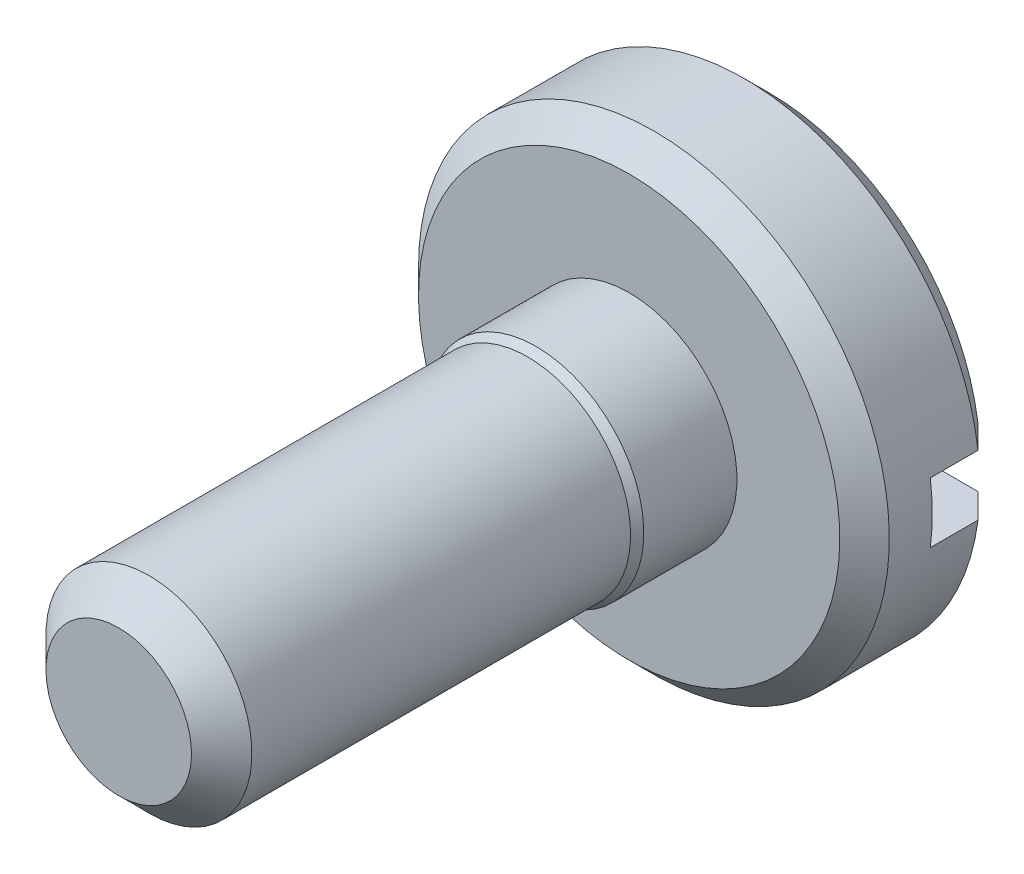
ISO-10303-21;
HEADER;
FILE_DESCRIPTION(('STEP AP214'),'2;1');
FILE_NAME('part.step','',(''),(''),'','','');
FILE_SCHEMA(('AUTOMOTIVE_DESIGN { 1 0 10303 214 1 1 1 1 }'));
ENDSEC;
DATA;
#1=APPLICATION_CONTEXT('core data for automotive mechanical design processes');
#2=APPLICATION_PROTOCOL_DEFINITION('international standard','automotive_design',2000,#1);
#3=PRODUCT_CONTEXT('',#1,'mechanical');
#4=PRODUCT('Part','Part','',(#3));
#5=PRODUCT_RELATED_PRODUCT_CATEGORY('part','',(#4));
#6=PRODUCT_DEFINITION_FORMATION('','',#4);
#7=PRODUCT_DEFINITION_CONTEXT('part definition',#1,'design');
#8=PRODUCT_DEFINITION('design','',#6,#7);
#9=PRODUCT_DEFINITION_SHAPE('','',#8);
#10=(LENGTH_UNIT() NAMED_UNIT(*) SI_UNIT(.MILLI.,.METRE.));
#11=(NAMED_UNIT(*) PLANE_ANGLE_UNIT() SI_UNIT($,.RADIAN.));
#12=(NAMED_UNIT(*) SI_UNIT($,.STERADIAN.) SOLID_ANGLE_UNIT());
#13=UNCERTAINTY_MEASURE_WITH_UNIT(LENGTH_MEASURE(1.E-05),#10,'distance_accuracy_value','');
#14=(GEOMETRIC_REPRESENTATION_CONTEXT(3) GLOBAL_UNCERTAINTY_ASSIGNED_CONTEXT((#13)) GLOBAL_UNIT_ASSIGNED_CONTEXT((#10,
#11,#12)) REPRESENTATION_CONTEXT('',''));
#15=CARTESIAN_POINT('',(0.,0.,0.));
#16=DIRECTION('',(0.,0.,1.));
#17=DIRECTION('',(1.,0.,0.));
#18=AXIS2_PLACEMENT_3D('',#15,#16,#17);
#19=CARTESIAN_POINT('',(-6.1849,0.79375,-15.1892));
#20=DIRECTION('',(0.,0.,1.));
#21=DIRECTION('',(1.,0.,0.));
#22=AXIS2_PLACEMENT_3D('',#19,#20,#21);
#23=PLANE('',#22);
#24=DIRECTION('',(1.,0.,0.));
#25=VECTOR('',#24,1.);
#26=CARTESIAN_POINT('',(-6.1849,-0.79375,-15.1892));
#27=LINE('',#26,#25);
#28=CARTESIAN_POINT('',(6.13375488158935,-0.79375,-15.1892));
#29=VERTEX_POINT('',#28);
#30=CARTESIAN_POINT('',(-6.13375488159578,-0.79375,-15.1892));
#31=VERTEX_POINT('',#30);
#32=EDGE_CURVE('E74',#29,#31,#27,.F.);
#33=ORIENTED_EDGE('',*,*,#32,.T.);
#34=CARTESIAN_POINT('',(0.,0.,-15.1892));
#35=DIRECTION('',(0.,0.,1.));
#36=DIRECTION('',(0.,-1.,0.));
#37=AXIS2_PLACEMENT_3D('',#34,#35,#36);
#38=CIRCLE('',#37,6.1849);
#39=CARTESIAN_POINT('',(-6.13375488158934,0.79375,-15.1892));
#40=VERTEX_POINT('',#39);
#41=EDGE_CURVE('E21',#40,#31,#38,.T.);
#42=ORIENTED_EDGE('',*,*,#41,.F.);
#43=DIRECTION('',(1.,0.,0.));
#44=VECTOR('',#43,1.);
#45=CARTESIAN_POINT('',(-6.1849,0.79375,-15.1892));
#46=LINE('',#45,#44);
#47=CARTESIAN_POINT('',(6.13375488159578,0.79375,-15.1892));
#48=VERTEX_POINT('',#47);
#49=EDGE_CURVE('E71',#40,#48,#46,.T.);
#50=ORIENTED_EDGE('',*,*,#49,.T.);
#51=CARTESIAN_POINT('',(0.,0.,-15.1892));
#52=DIRECTION('',(0.,0.,1.));
#53=DIRECTION('',(0.,-1.,0.));
#54=AXIS2_PLACEMENT_3D('',#51,#52,#53);
#55=CIRCLE('',#54,6.1849);
#56=EDGE_CURVE('E78',#29,#48,#55,.T.);
#57=ORIENTED_EDGE('',*,*,#56,.F.);
#58=EDGE_LOOP('',(#33,#42,#50,#57));
#59=FACE_BOUND('',#58,.T.);
#60=ADVANCED_FACE('F18',(#59),#23,.F.);
#61=CARTESIAN_POINT('',(-6.1849,0.79375,-17.0942));
#62=DIRECTION('',(0.,1.,0.));
#63=DIRECTION('',(0.,0.,1.));
#64=AXIS2_PLACEMENT_3D('',#61,#62,#63);
#65=PLANE('',#64);
#66=CARTESIAN_POINT('',(-5.47680505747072,0.79375,-17.0941999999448));
#67=CARTESIAN_POINT('',(-5.58635318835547,0.79375,-16.9857778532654));
#68=CARTESIAN_POINT('',(-5.69587307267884,0.79375,-16.8773271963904));
#69=CARTESIAN_POINT('',(-5.91485634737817,0.79375,-16.6603688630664));
#70=CARTESIAN_POINT('',(-6.02431973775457,0.79375,-16.5518611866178));
#71=CARTESIAN_POINT('',(-6.13375488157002,0.79375,-16.4433249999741));
#72=B_SPLINE_CURVE_WITH_KNOTS('',3,(#66,#67,#68,#69,#70,#71),.UNSPECIFIED.,.F.,.F.,(4,2,4),(0.,
0.462390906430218,0.924781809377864),.UNSPECIFIED.);
#73=CARTESIAN_POINT('',(-5.47680505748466,0.79375,-17.094199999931));
#74=VERTEX_POINT('',#73);
#75=CARTESIAN_POINT('',(-6.13375488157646,0.79375,-16.443324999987));
#76=VERTEX_POINT('',#75);
#77=EDGE_CURVE('E86',#74,#76,#72,.T.);
#78=ORIENTED_EDGE('',*,*,#77,.F.);
#79=DIRECTION('',(1.,0.,0.));
#80=VECTOR('',#79,1.);
#81=CARTESIAN_POINT('',(0.,0.79375,-17.0942));
#82=LINE('',#81,#80);
#83=CARTESIAN_POINT('',(5.47680505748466,0.79375,-17.094199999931));
#84=VERTEX_POINT('',#83);
#85=EDGE_CURVE('E216',#74,#84,#82,.T.);
#86=ORIENTED_EDGE('',*,*,#85,.T.);
#87=CARTESIAN_POINT('',(6.13375488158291,0.79375,-16.4433249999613));
#88=CARTESIAN_POINT('',(6.02431973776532,0.79375,-16.5518611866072));
#89=CARTESIAN_POINT('',(5.91485634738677,0.79375,-16.6603688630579));
#90=CARTESIAN_POINT('',(5.69587307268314,0.79375,-16.8773271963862));
#91=CARTESIAN_POINT('',(5.58635318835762,0.79375,-16.9857778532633));
#92=CARTESIAN_POINT('',(5.47680505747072,0.79375,-17.0941999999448));
#93=B_SPLINE_CURVE_WITH_KNOTS('',3,(#87,#88,#89,#90,#91,#92),.UNSPECIFIED.,.F.,.F.,(4,2,4),(0.,
0.462390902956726,0.924781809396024),.UNSPECIFIED.);
#94=CARTESIAN_POINT('',(6.13375488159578,0.79375,-16.4433249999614));
#95=VERTEX_POINT('',#94);
#96=EDGE_CURVE('E92',#95,#84,#93,.T.);
#97=ORIENTED_EDGE('',*,*,#96,.F.);
#98=DIRECTION('',(0.,0.,1.));
#99=VECTOR('',#98,1.);
#100=CARTESIAN_POINT('',(6.13375488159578,0.79375,-17.0942));
#101=LINE('',#100,#99);
#102=EDGE_CURVE('E90',#48,#95,#101,.F.);
#103=ORIENTED_EDGE('',*,*,#102,.F.);
#104=ORIENTED_EDGE('',*,*,#49,.F.);
#105=DIRECTION('',(0.,0.,1.));
#106=VECTOR('',#105,1.);
#107=CARTESIAN_POINT('',(-6.13375488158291,0.79375,-17.0942));
#108=LINE('',#107,#106);
#109=EDGE_CURVE('E80',#76,#40,#108,.T.);
#110=ORIENTED_EDGE('',*,*,#109,.F.);
#111=EDGE_LOOP('',(#78,#86,#97,#103,#104,#110));
#112=FACE_BOUND('',#111,.T.);
#113=ADVANCED_FACE('F88',(#112),#65,.F.);
#114=CARTESIAN_POINT('',(-6.1849,-0.79375,-17.0942));
#115=DIRECTION('',(0.,-1.,0.));
#116=DIRECTION('',(0.,0.,-1.));
#117=AXIS2_PLACEMENT_3D('',#114,#115,#116);
#118=PLANE('',#117);
#119=CARTESIAN_POINT('',(5.47680505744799,-0.79375,-17.0941999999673));
#120=CARTESIAN_POINT('',(5.58635318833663,-0.79375,-16.9857778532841));
#121=CARTESIAN_POINT('',(5.69587307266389,-0.79375,-16.8773271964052));
#122=CARTESIAN_POINT('',(5.91485634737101,-0.79375,-16.6603688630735));
#123=CARTESIAN_POINT('',(6.02431973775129,-0.79375,-16.5518611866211));
#124=CARTESIAN_POINT('',(6.13375488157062,-0.79375,-16.4433249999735));
#125=B_SPLINE_CURVE_WITH_KNOTS('',3,(#119,#120,#121,#122,#123,#124),.UNSPECIFIED.,.F.,.F.,(4,2,
4),(0.,0.462390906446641,0.924781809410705),.UNSPECIFIED.);
#126=CARTESIAN_POINT('',(5.47680505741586,-0.79375,-17.0941999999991));
#127=VERTEX_POINT('',#126);
#128=CARTESIAN_POINT('',(6.13375488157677,-0.79375,-16.4433249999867));
#129=VERTEX_POINT('',#128);
#130=EDGE_CURVE('E36',#127,#129,#125,.T.);
#131=ORIENTED_EDGE('',*,*,#130,.F.);
#132=DIRECTION('',(1.,0.,0.));
#133=VECTOR('',#132,1.);
#134=CARTESIAN_POINT('',(0.,-0.79375,-17.0942));
#135=LINE('',#134,#133);
#136=CARTESIAN_POINT('',(-5.47680505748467,-0.79375,-17.094199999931));
#137=VERTEX_POINT('',#136);
#138=EDGE_CURVE('E113',#127,#137,#135,.F.);
#139=ORIENTED_EDGE('',*,*,#138,.T.);
#140=CARTESIAN_POINT('',(-6.13375488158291,-0.79375,-16.4433249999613));
#141=CARTESIAN_POINT('',(-6.02431973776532,-0.79375,-16.5518611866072));
#142=CARTESIAN_POINT('',(-5.91485634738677,-0.79375,-16.6603688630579));
#143=CARTESIAN_POINT('',(-5.69587307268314,-0.79375,-16.8773271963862));
#144=CARTESIAN_POINT('',(-5.58635318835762,-0.79375,-16.9857778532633));
#145=CARTESIAN_POINT('',(-5.47680505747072,-0.79375,-17.0941999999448));
#146=B_SPLINE_CURVE_WITH_KNOTS('',3,(#140,#141,#142,#143,#144,#145),.UNSPECIFIED.,.F.,.F.,(4,2,
4),(0.,0.462390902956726,0.924781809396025),.UNSPECIFIED.);
#147=CARTESIAN_POINT('',(-6.13375488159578,-0.79375,-16.4433249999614));
#148=VERTEX_POINT('',#147);
#149=EDGE_CURVE('E122',#148,#137,#146,.T.);
#150=ORIENTED_EDGE('',*,*,#149,.F.);
#151=DIRECTION('',(0.,0.,-1.));
#152=VECTOR('',#151,1.);
#153=CARTESIAN_POINT('',(-6.13375488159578,-0.79375,-17.0942));
#154=LINE('',#153,#152);
#155=EDGE_CURVE('E221',#31,#148,#154,.T.);
#156=ORIENTED_EDGE('',*,*,#155,.F.);
#157=ORIENTED_EDGE('',*,*,#32,.F.);
#158=DIRECTION('',(0.,0.,-1.));
#159=VECTOR('',#158,1.);
#160=CARTESIAN_POINT('',(6.13375488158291,-0.79375,-17.0942));
#161=LINE('',#160,#159);
#162=EDGE_CURVE('E121',#129,#29,#161,.F.);
#163=ORIENTED_EDGE('',*,*,#162,.F.);
#164=EDGE_LOOP('',(#131,#139,#150,#156,#157,#163));
#165=FACE_BOUND('',#164,.T.);
#166=ADVANCED_FACE('F128',(#165),#118,.F.);
#167=CARTESIAN_POINT('',(0.,0.,-17.0942));
#168=DIRECTION('',(0.,0.,1.));
#169=DIRECTION('',(0.,-1.,0.));
#170=AXIS2_PLACEMENT_3D('',#167,#168,#169);
#171=PLANE('',#170);
#172=CARTESIAN_POINT('',(0.,0.,-17.0941999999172));
#173=DIRECTION('',(0.,0.,1.));
#174=DIRECTION('',(0.,-1.,0.));
#175=AXIS2_PLACEMENT_3D('',#172,#173,#174);
#176=CIRCLE('',#175,5.53402499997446);
#177=EDGE_CURVE('E110',#84,#74,#176,.T.);
#178=ORIENTED_EDGE('',*,*,#177,.F.);
#179=ORIENTED_EDGE('',*,*,#85,.F.);
#180=EDGE_LOOP('',(#178,#179));
#181=FACE_BOUND('',#180,.T.);
#182=ADVANCED_FACE('F163',(#181),#171,.F.);
#183=CARTESIAN_POINT('',(0.,0.,-17.0942));
#184=DIRECTION('',(0.,0.,1.));
#185=DIRECTION('',(0.,-1.,0.));
#186=AXIS2_PLACEMENT_3D('',#183,#184,#185);
#187=PLANE('',#186);
#188=CARTESIAN_POINT('',(0.,0.,-17.0942000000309));
#189=DIRECTION('',(0.,0.,1.));
#190=DIRECTION('',(0.,-1.,0.));
#191=AXIS2_PLACEMENT_3D('',#188,#189,#190);
#192=CIRCLE('',#191,5.53402499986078);
#193=EDGE_CURVE('E107',#137,#127,#192,.T.);
#194=ORIENTED_EDGE('',*,*,#193,.F.);
#195=ORIENTED_EDGE('',*,*,#138,.F.);
#196=EDGE_LOOP('',(#194,#195));
#197=FACE_BOUND('',#196,.T.);
#198=ADVANCED_FACE('F143',(#197),#187,.F.);
#199=CARTESIAN_POINT('',(0.,0.,-16.4433250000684));
#200=DIRECTION('',(0.,0.,1.));
#201=DIRECTION('',(0.,-1.,0.));
#202=AXIS2_PLACEMENT_3D('',#199,#200,#201);
#203=CONICAL_SURFACE('',#202,6.18489999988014,0.785398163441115);
#204=ORIENTED_EDGE('',*,*,#96,.T.);
#205=ORIENTED_EDGE('',*,*,#177,.T.);
#206=ORIENTED_EDGE('',*,*,#77,.T.);
#207=CARTESIAN_POINT('',(0.,0.,-16.4433249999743));
#208=DIRECTION('',(0.,0.,1.));
#209=DIRECTION('',(0.,-1.,0.));
#210=AXIS2_PLACEMENT_3D('',#207,#208,#209);
#211=CIRCLE('',#210,6.1849);
#212=EDGE_CURVE('E83',#95,#76,#211,.T.);
#213=ORIENTED_EDGE('',*,*,#212,.F.);
#214=EDGE_LOOP('',(#204,#205,#206,#213));
#215=FACE_BOUND('',#214,.T.);
#216=ADVANCED_FACE('F136',(#215),#203,.T.);
#217=CARTESIAN_POINT('',(0.,0.,-16.4433250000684));
#218=DIRECTION('',(0.,0.,1.));
#219=DIRECTION('',(0.,-1.,0.));
#220=AXIS2_PLACEMENT_3D('',#217,#218,#219);
#221=CONICAL_SURFACE('',#220,6.18489999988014,0.785398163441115);
#222=ORIENTED_EDGE('',*,*,#130,.T.);
#223=CARTESIAN_POINT('',(0.,0.,-16.443325));
#224=DIRECTION('',(0.,0.,1.));
#225=DIRECTION('',(0.,-1.,0.));
#226=AXIS2_PLACEMENT_3D('',#223,#224,#225);
#227=CIRCLE('',#226,6.1849);
#228=EDGE_CURVE('E203',#148,#129,#227,.T.);
#229=ORIENTED_EDGE('',*,*,#228,.F.);
#230=ORIENTED_EDGE('',*,*,#149,.T.);
#231=ORIENTED_EDGE('',*,*,#193,.T.);
#232=EDGE_LOOP('',(#222,#229,#230,#231));
#233=FACE_BOUND('',#232,.T.);
#234=ADVANCED_FACE('F131',(#233),#221,.T.);
#235=CARTESIAN_POINT('',(0.,0.,0.));
#236=DIRECTION('',(0.,0.,1.));
#237=DIRECTION('',(0.,-1.,0.));
#238=AXIS2_PLACEMENT_3D('',#235,#236,#237);
#239=CYLINDRICAL_SURFACE('',#238,6.1849);
#240=CARTESIAN_POINT('',(0.,0.,-14.0620750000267));
#241=DIRECTION('',(0.,0.,-1.));
#242=DIRECTION('',(0.,1.,0.));
#243=AXIS2_PLACEMENT_3D('',#240,#241,#242);
#244=CIRCLE('',#243,6.18489999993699);
#245=CARTESIAN_POINT('',(0.,6.18489999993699,-14.0620750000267));
#246=VERTEX_POINT('',#245);
#247=EDGE_CURVE('E106',#246,#246,#244,.F.);
#248=ORIENTED_EDGE('',*,*,#247,.F.);
#249=EDGE_LOOP('',(#248));
#250=FACE_BOUND('',#249,.T.);
#251=ORIENTED_EDGE('',*,*,#56,.T.);
#252=ORIENTED_EDGE('',*,*,#102,.T.);
#253=ORIENTED_EDGE('',*,*,#212,.T.);
#254=ORIENTED_EDGE('',*,*,#109,.T.);
#255=ORIENTED_EDGE('',*,*,#41,.T.);
#256=ORIENTED_EDGE('',*,*,#155,.T.);
#257=ORIENTED_EDGE('',*,*,#228,.T.);
#258=ORIENTED_EDGE('',*,*,#162,.T.);
#259=EDGE_LOOP('',(#251,#252,#253,#254,#255,#256,#257,#258));
#260=FACE_BOUND('',#259,.T.);
#261=ADVANCED_FACE('F81',(#250,#260),#239,.T.);
#262=CARTESIAN_POINT('',(0.,0.,-14.0620750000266));
#263=DIRECTION('',(0.,0.,-1.));
#264=DIRECTION('',(0.,1.,0.));
#265=AXIS2_PLACEMENT_3D('',#262,#263,#264);
#266=CONICAL_SURFACE('',#265,6.18489999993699,0.785398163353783);
#267=ORIENTED_EDGE('',*,*,#247,.T.);
#268=EDGE_LOOP('',(#267));
#269=FACE_BOUND('',#268,.T.);
#270=CARTESIAN_POINT('',(0.,0.,-13.4111999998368));
#271=DIRECTION('',(0.,0.,-1.));
#272=DIRECTION('',(0.,1.,0.));
#273=AXIS2_PLACEMENT_3D('',#270,#271,#272);
#274=CIRCLE('',#273,5.53402499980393);
#275=CARTESIAN_POINT('',(0.,5.53402499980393,-13.4111999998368));
#276=VERTEX_POINT('',#275);
#277=EDGE_CURVE('E103',#276,#276,#274,.T.);
#278=ORIENTED_EDGE('',*,*,#277,.T.);
#279=EDGE_LOOP('',(#278));
#280=FACE_BOUND('',#279,.T.);
#281=ADVANCED_FACE('F190',(#269,#280),#266,.T.);
#282=CARTESIAN_POINT('',(0.,2.8321,-13.4112));
#283=DIRECTION('',(0.,0.,-1.));
#284=DIRECTION('',(0.,1.,0.));
#285=AXIS2_PLACEMENT_3D('',#282,#283,#284);
#286=PLANE('',#285);
#287=CARTESIAN_POINT('',(0.,0.,-13.4112));
#288=DIRECTION('',(0.,0.,1.));
#289=DIRECTION('',(0.,-1.,0.));
#290=AXIS2_PLACEMENT_3D('',#287,#288,#289);
#291=CIRCLE('',#290,2.8321);
#292=CARTESIAN_POINT('',(0.,-2.83210000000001,-13.4112));
#293=VERTEX_POINT('',#292);
#294=EDGE_CURVE('E100',#293,#293,#291,.T.);
#295=ORIENTED_EDGE('',*,*,#294,.F.);
#296=EDGE_LOOP('',(#295));
#297=FACE_BOUND('',#296,.T.);
#298=ORIENTED_EDGE('',*,*,#277,.F.);
#299=EDGE_LOOP('',(#298));
#300=FACE_BOUND('',#299,.T.);
#301=ADVANCED_FACE('F187',(#297,#300),#286,.F.);
#302=CARTESIAN_POINT('',(0.,0.,0.));
#303=DIRECTION('',(0.,0.,1.));
#304=DIRECTION('',(0.,-1.,0.));
#305=AXIS2_PLACEMENT_3D('',#302,#303,#304);
#306=CYLINDRICAL_SURFACE('',#305,2.8321);
#307=CARTESIAN_POINT('',(0.,0.,-10.9641704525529));
#308=DIRECTION('',(0.,0.,-1.));
#309=DIRECTION('',(0.,1.,0.));
#310=AXIS2_PLACEMENT_3D('',#307,#308,#309);
#311=CIRCLE('',#310,2.83210000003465);
#312=CARTESIAN_POINT('',(0.,2.83210000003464,-10.9641704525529));
#313=VERTEX_POINT('',#312);
#314=EDGE_CURVE('E99',#313,#313,#311,.F.);
#315=ORIENTED_EDGE('',*,*,#314,.F.);
#316=EDGE_LOOP('',(#315));
#317=FACE_BOUND('',#316,.T.);
#318=ORIENTED_EDGE('',*,*,#294,.T.);
#319=EDGE_LOOP('',(#318));
#320=FACE_BOUND('',#319,.T.);
#321=ADVANCED_FACE('F183',(#317,#320),#306,.T.);
#322=CARTESIAN_POINT('',(0.,0.,0.));
#323=DIRECTION('',(0.,0.,-1.));
#324=DIRECTION('',(0.,1.,0.));
#325=AXIS2_PLACEMENT_3D('',#322,#323,#324);
#326=PLANE('',#325);
#327=CARTESIAN_POINT('',(0.,0.,-2.27373458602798E-10));
#328=DIRECTION('',(0.,0.,-1.));
#329=DIRECTION('',(0.,1.,0.));
#330=AXIS2_PLACEMENT_3D('',#327,#328,#329);
#331=CIRCLE('',#330,1.91135000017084);
#332=CARTESIAN_POINT('',(0.,1.91135000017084,-2.27373803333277E-10));
#333=VERTEX_POINT('',#332);
#334=EDGE_CURVE('E96',#333,#333,#331,.T.);
#335=ORIENTED_EDGE('',*,*,#334,.F.);
#336=EDGE_LOOP('',(#335));
#337=FACE_BOUND('',#336,.T.);
#338=ADVANCED_FACE('F179',(#337),#326,.F.);
#339=CARTESIAN_POINT('',(0.,0.,-10.9641704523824));
#340=DIRECTION('',(0.,0.,-1.));
#341=DIRECTION('',(0.,1.,0.));
#342=AXIS2_PLACEMENT_3D('',#339,#340,#341);
#343=CONICAL_SURFACE('',#342,2.83209999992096,0.523598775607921);
#344=ORIENTED_EDGE('',*,*,#314,.T.);
#345=EDGE_LOOP('',(#344));
#346=FACE_BOUND('',#345,.T.);
#347=CARTESIAN_POINT('',(0.,0.,-10.7442));
#348=DIRECTION('',(0.,0.,1.));
#349=DIRECTION('',(0.,-1.,0.));
#350=AXIS2_PLACEMENT_3D('',#347,#348,#349);
#351=CIRCLE('',#350,2.7051);
#352=CARTESIAN_POINT('',(0.,-2.7051,-10.7442));
#353=VERTEX_POINT('',#352);
#354=EDGE_CURVE('E27',#353,#353,#351,.T.);
#355=ORIENTED_EDGE('',*,*,#354,.F.);
#356=EDGE_LOOP('',(#355));
#357=FACE_BOUND('',#356,.T.);
#358=ADVANCED_FACE('F172',(#346,#357),#343,.T.);
#359=CARTESIAN_POINT('',(0.,0.,-0.793750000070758));
#360=DIRECTION('',(0.,0.,-1.));
#361=DIRECTION('',(0.,1.,0.));
#362=AXIS2_PLACEMENT_3D('',#359,#360,#361);
#363=CONICAL_SURFACE('',#362,2.70510000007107,0.785398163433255);
#364=CARTESIAN_POINT('',(0.,0.,-0.793749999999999));
#365=DIRECTION('',(0.,0.,1.));
#366=DIRECTION('',(0.,-1.,0.));
#367=AXIS2_PLACEMENT_3D('',#364,#365,#366);
#368=CIRCLE('',#367,2.7051);
#369=CARTESIAN_POINT('',(0.,-2.7051,-0.793749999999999));
#370=VERTEX_POINT('',#369);
#371=EDGE_CURVE('E11',#370,#370,#368,.F.);
#372=ORIENTED_EDGE('',*,*,#371,.F.);
#373=EDGE_LOOP('',(#372));
#374=FACE_BOUND('',#373,.T.);
#375=ORIENTED_EDGE('',*,*,#334,.T.);
#376=EDGE_LOOP('',(#375));
#377=FACE_BOUND('',#376,.T.);
#378=ADVANCED_FACE('F166',(#374,#377),#363,.T.);
#379=CARTESIAN_POINT('',(0.,0.,0.));
#380=DIRECTION('',(0.,0.,1.));
#381=DIRECTION('',(0.,-1.,0.));
#382=AXIS2_PLACEMENT_3D('',#379,#380,#381);
#383=CYLINDRICAL_SURFACE('',#382,2.7051);
#384=ORIENTED_EDGE('',*,*,#371,.T.);
#385=EDGE_LOOP('',(#384));
#386=FACE_BOUND('',#385,.T.);
#387=ORIENTED_EDGE('',*,*,#354,.T.);
#388=EDGE_LOOP('',(#387));
#389=FACE_BOUND('',#388,.T.);
#390=ADVANCED_FACE('F164',(#386,#389),#383,.T.);
#391=CLOSED_SHELL('',(#60,#113,#166,#182,#198,#216,#234,#261,#281,#301,#321,#338,#358,#378,#390));
#392=MANIFOLD_SOLID_BREP('B1',#391);
#393=ADVANCED_BREP_SHAPE_REPRESENTATION('',(#18,#392),#14);
#394=SHAPE_DEFINITION_REPRESENTATION(#9,#393);
ENDSEC;
END-ISO-10303-21;
